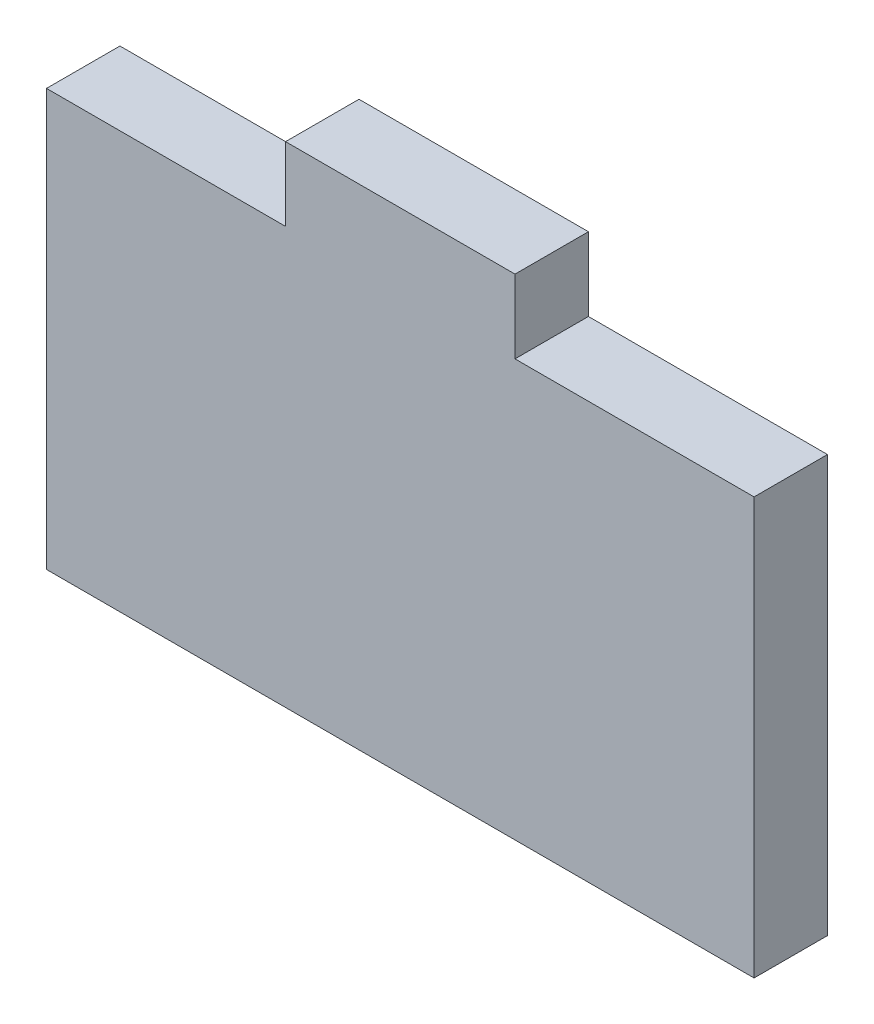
from build123d import *

# Parameters (mm, degrees)
SKETCH1_W           = 154.2
SKETCH1_H           = 90.8
SKETCH1_W_2         = 50
SKETCH1_H_2         = 16
BOSS_EXTRUDE1_DEPTH = 16


with BuildPart() as part:
    # Sketch1 → Boss-Extrude1 (new body)
    with BuildSketch(Plane.XY):
        with Locations((77.1, 45.4)):
            Rectangle(SKETCH1_W, SKETCH1_H)
        with Locations((77.1, 98.8)):
            Rectangle(SKETCH1_W_2, SKETCH1_H_2)
    extrude(amount=BOSS_EXTRUDE1_DEPTH)


solid = part.part
